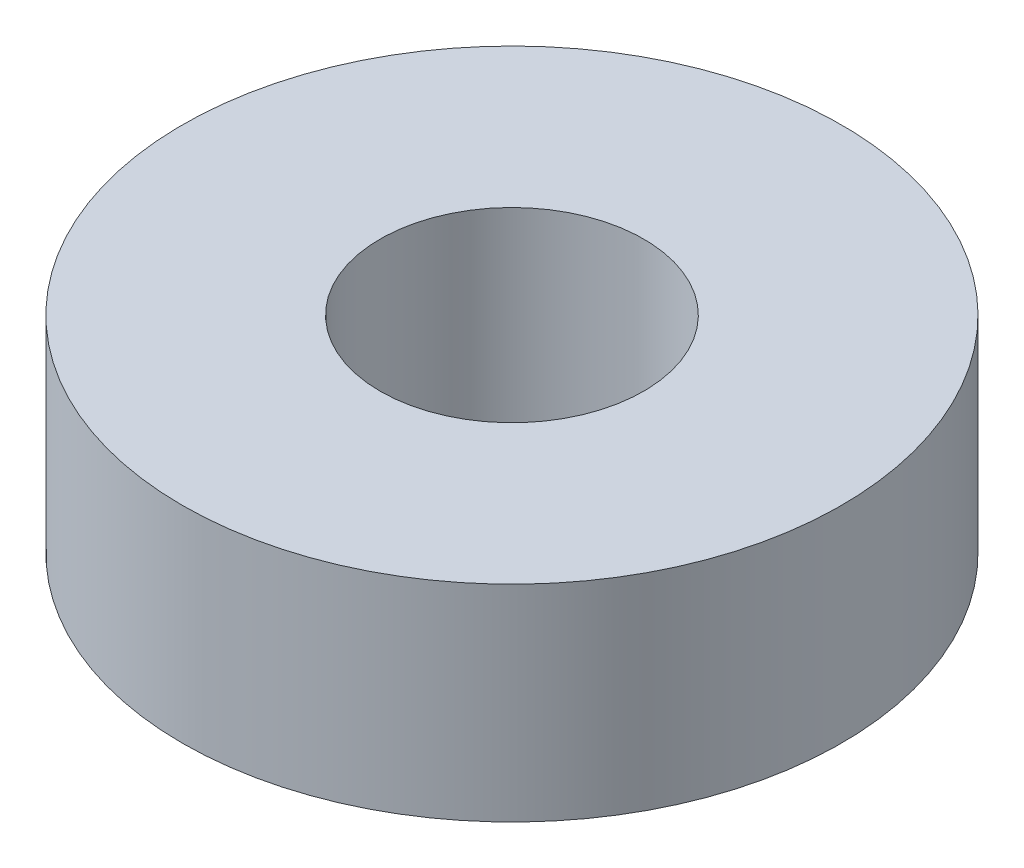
from build123d import *

# Parameters (mm, degrees)
SKETCH1_R          = 6.35
SKETCH1_R_2        = 2.54
BASE_EXTRUDE_DEPTH = 3.96875


with BuildPart() as part:
    # Sketch1 → Base-Extrude (new body)
    with BuildSketch(Plane(origin=(0, 0, 0), x_dir=(1, 0, 0), z_dir=(0, 1, 0))):
        with Locations(Location((0, 0, 0), (0, 0, 270))):
            Circle(SKETCH1_R)
        with Locations(Location((0, 0, 0), (0, 0, 270))):
            Circle(SKETCH1_R_2, mode=Mode.SUBTRACT)
    extrude(amount=BASE_EXTRUDE_DEPTH)


solid = part.part
